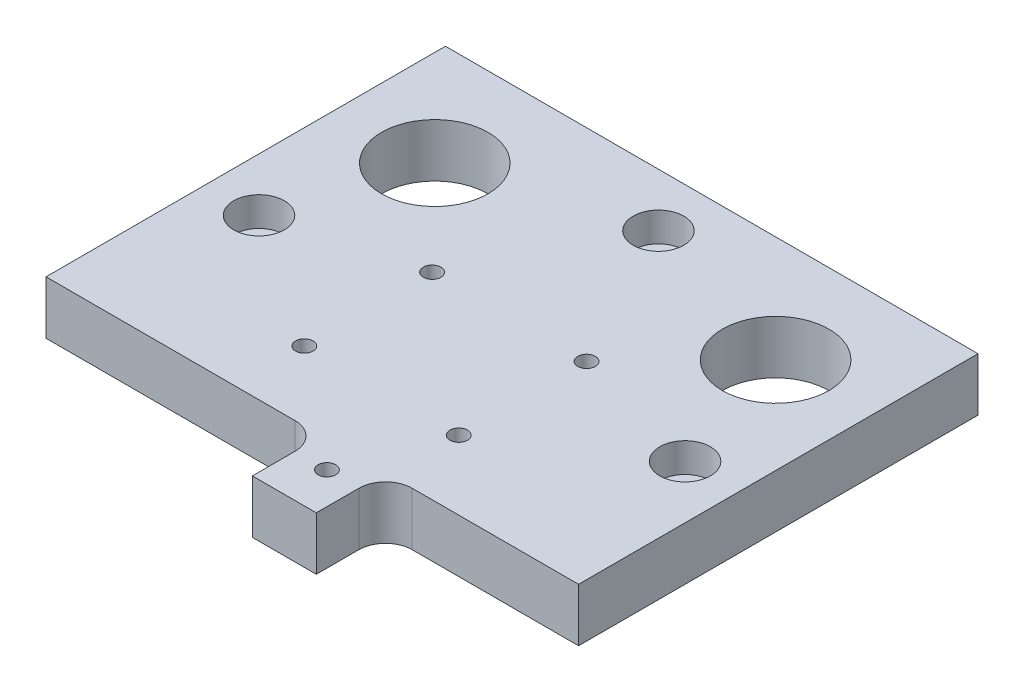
from build123d import *

# Parameters (mm, degrees)
SKETCH_1_W           = 100
SKETCH_1_H           = 10
EXTRUDE_1_DEPTH      = 88
SKETCH_2_OUTSIDE_W   = 128.716
SKETCH_2_OUTSIDE_H   = 116.716
SKETCH_2_OUTSIDE_R   = 10
SKETCH_2_OUTSIDE_R_2 = 1.65
SKETCH_2_OUTSIDE_R_3 = 2.75
CUT_EXTRUDE_1_DEPTH  = 88
SKETCH_3_R           = 4.75
CUT_EXTRUDE_2_DEPTH  = 5.5
SKETCH_5_R           = 3.25
CUT_EXTRUDE_3_DEPTH  = 5.5


with BuildPart() as part:
    # Sketch 1 → Extrude 1 (new body)
    with BuildSketch(Plane.XY):
        with Locations((50, 5)):
            Rectangle(SKETCH_1_W, SKETCH_1_H)
    extrude(amount=EXTRUDE_1_DEPTH)

    # Sketch 2 outside → Cut-Extrude 1 (cut)
    # profile 1 of 11: a face of its own
    with BuildSketch(Plane(origin=(0, 10, 0), x_dir=(1, 0, 0), z_dir=(0, 1, 0))):
        with Locations((50, -44)):
            Rectangle(SKETCH_2_OUTSIDE_W, SKETCH_2_OUTSIDE_H)
        with BuildLine():
            Line((0, 0), (100, 0))
            Line((100, 0), (100, -75))
            Line((100, -75), (68.75, -75))
            ThreePointArc((68.75, -75), (65.214466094, -76.464466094), (63.75, -80))
            Line((63.75, -80), (63.75, -88))
            Line((63.75, -88), (51.75, -88))
            Line((51.75, -88), (51.75, -80))
            ThreePointArc((51.75, -80), (50.285533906, -76.464466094), (46.75, -75))
            Line((46.75, -75), (0, -75))
            Line((0, -75), (0, 0))
        make_face(mode=Mode.SUBTRACT)
    # profile 2 of 11: a face of its own
    with BuildSketch(Plane(origin=(0, 10, 0), x_dir=(1, 0, 0), z_dir=(0, 1, 0))):
        with Locations(Location((18, -20, 0), (0, 0, 270))):
            Circle(SKETCH_2_OUTSIDE_R)
    # profile 3 of 11: a face of its own
    with BuildSketch(Plane(origin=(0, 10, 0), x_dir=(1, 0, 0), z_dir=(0, 1, 0))):
        with Locations(Location((82, -20, 0), (0, 0, 270))):
            Circle(SKETCH_2_OUTSIDE_R)
    # profile 4 of 11: a face of its own
    with BuildSketch(Plane(origin=(0, 10, 0), x_dir=(1, 0, 0), z_dir=(0, 1, 0))):
        with Locations(Location((57.75, -80, 0), (0, 0, 270))):
            Circle(SKETCH_2_OUTSIDE_R_2)
    # profile 5 of 11: a face of its own
    with BuildSketch(Plane(origin=(0, 10, 0), x_dir=(1, 0, 0), z_dir=(0, 1, 0))):
        with Locations(Location((50, -10, 0), (0, 0, 270))):
            Circle(SKETCH_2_OUTSIDE_R_3)
    # profile 6 of 11: a face of its own
    with BuildSketch(Plane(origin=(0, 10, 0), x_dir=(1, 0, 0), z_dir=(0, 1, 0))):
        with Locations(Location((10, -45, 0), (0, 0, 270))):
            Circle(SKETCH_2_OUTSIDE_R_3)
    # profile 7 of 11: a face of its own
    with BuildSketch(Plane(origin=(0, 10, 0), x_dir=(1, 0, 0), z_dir=(0, 1, 0))):
        with Locations(Location((90, -45, 0), (0, 0, 270))):
            Circle(SKETCH_2_OUTSIDE_R_3)
    # profile 8 of 11: a face of its own
    with BuildSketch(Plane(origin=(0, 10, 0), x_dir=(1, 0, 0), z_dir=(0, 1, 0))):
        with Locations(Location((64.5, -62, 0), (0, 0, 270))):
            Circle(SKETCH_2_OUTSIDE_R_2)
    # profile 9 of 11: a face of its own
    with BuildSketch(Plane(origin=(0, 10, 0), x_dir=(1, 0, 0), z_dir=(0, 1, 0))):
        with Locations(Location((64.5, -38, 0), (0, 0, 270))):
            Circle(SKETCH_2_OUTSIDE_R_2)
    # profile 10 of 11: a face of its own
    with BuildSketch(Plane(origin=(0, 10, 0), x_dir=(1, 0, 0), z_dir=(0, 1, 0))):
        with Locations(Location((35.5, -38, 0), (0, 0, 270))):
            Circle(SKETCH_2_OUTSIDE_R_2)
    # profile 11 of 11: a face of its own
    with BuildSketch(Plane(origin=(0, 10, 0), x_dir=(1, 0, 0), z_dir=(0, 1, 0))):
        with Locations(Location((35.5, -62, 0), (0, 0, 270))):
            Circle(SKETCH_2_OUTSIDE_R_2)
    extrude(amount=-CUT_EXTRUDE_1_DEPTH, mode=Mode.SUBTRACT)

    # Sketch 3 → Cut-Extrude 2 (cut)
    with BuildSketch(Plane(origin=(0, 10, 0), x_dir=(1, 0, 0), z_dir=(0, 1, 0))):
        with Locations(Location((50, -10, 0), (0, 0, 270))):
            Circle(SKETCH_3_R)
        with Locations(Location((10, -45, 0), (0, 0, 270))):
            Circle(SKETCH_3_R)
        with Locations(Location((90, -45, 0), (0, 0, 270))):
            Circle(SKETCH_3_R)
    extrude(amount=-CUT_EXTRUDE_2_DEPTH, mode=Mode.SUBTRACT)

    # Sketch 5 → Cut-Extrude 3 (cut)
    with BuildSketch(Plane.XZ):
        with Locations(Location((39.4975, 45, 0), (0, 0, 270))):
            Circle(SKETCH_5_R)
        with Locations(Location((56.9975, 45, 0), (0, 0, 270))):
            Circle(SKETCH_5_R)
    extrude(amount=-CUT_EXTRUDE_3_DEPTH, mode=Mode.SUBTRACT)


solid = part.part
